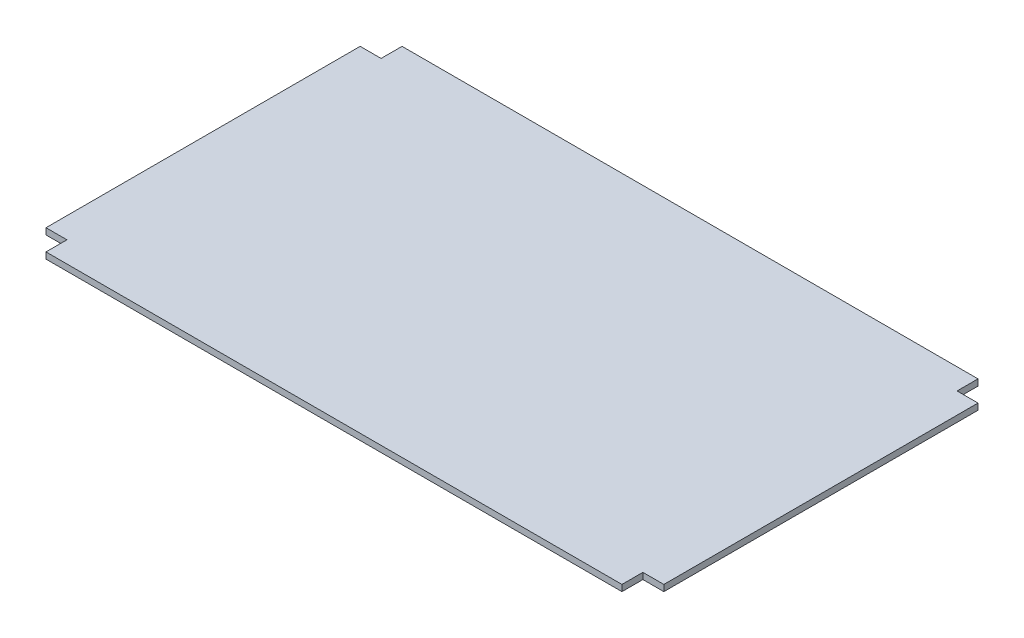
from build123d import *

# Parameters (mm, degrees)
BOSS_EXTRUDE1_DEPTH = 6


with BuildPart() as part:
    # Sketch1 → Boss-Extrude1 (new, symmetric)
    with BuildSketch(Plane(origin=(0, 0, 0), x_dir=(1, 0, 0), z_dir=(0, 1, 0))):
        Polygon((-550, -340), (550, -340), (550, -300), (590, -300), (590, 300), (550, 300), (550, 340), (-550, 340), (-550, 300), (-590, 300), (-590, -300), (-550, -300), align=None)
    extrude(amount=BOSS_EXTRUDE1_DEPTH, both=True)


solid = part.part
